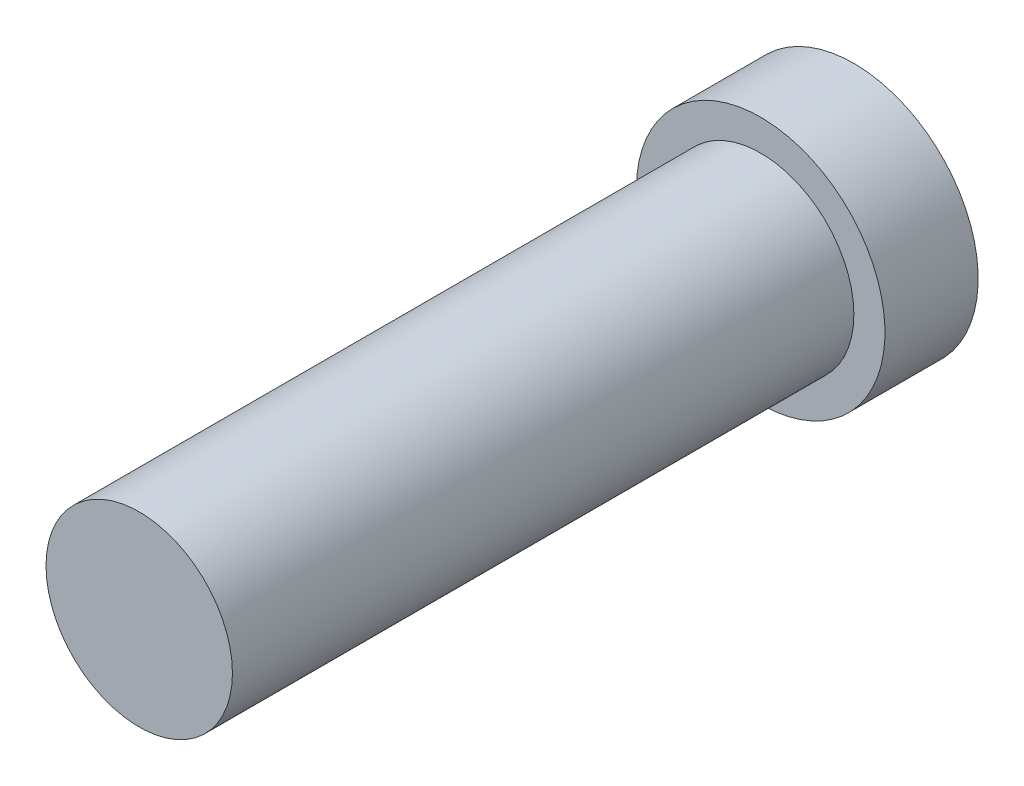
from build123d import *

# Parameters (mm, degrees)
SKETCH_1_R          = 1.5
EXTRUDE_1_DEPTH     = 10
SKETCH_2_R          = 2
EXTRUDE_2_DEPTH     = 1.5
CUT_EXTRUDE_1_DEPTH = 0.5


with BuildPart() as part:
    # Sketch 1 → Extrude 1 (new body)
    with BuildSketch(Plane.XY):
        Circle(SKETCH_1_R)
    extrude(amount=EXTRUDE_1_DEPTH)

    # Sketch 2 → Extrude 2 (add)
    with BuildSketch(Plane(origin=(0, 0, 0), x_dir=(-1, 0, 0), z_dir=(0, 0, -1))):
        Circle(SKETCH_2_R)
    extrude(amount=EXTRUDE_2_DEPTH)

    # Sketch 3 → Cut-Extrude 1 (cut)
    with BuildSketch(Plane(origin=(0, 0, -1.5), x_dir=(-1, 0, 0), z_dir=(0, 0, -1))):
        Polygon((-0.325, 0.325), (-0.325, 1.631111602), (0.325, 1.631111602), (0.325, 0.325), (1.643690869, 0.325), (1.643690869, -0.325), (0.325, -0.325), (0.325, -1.631111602), (-0.325, -1.631111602), (-0.325, -0.325), (-1.643690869, -0.325), (-1.643690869, 0.325), align=None)
    extrude(amount=-CUT_EXTRUDE_1_DEPTH, mode=Mode.SUBTRACT)


solid = part.part
